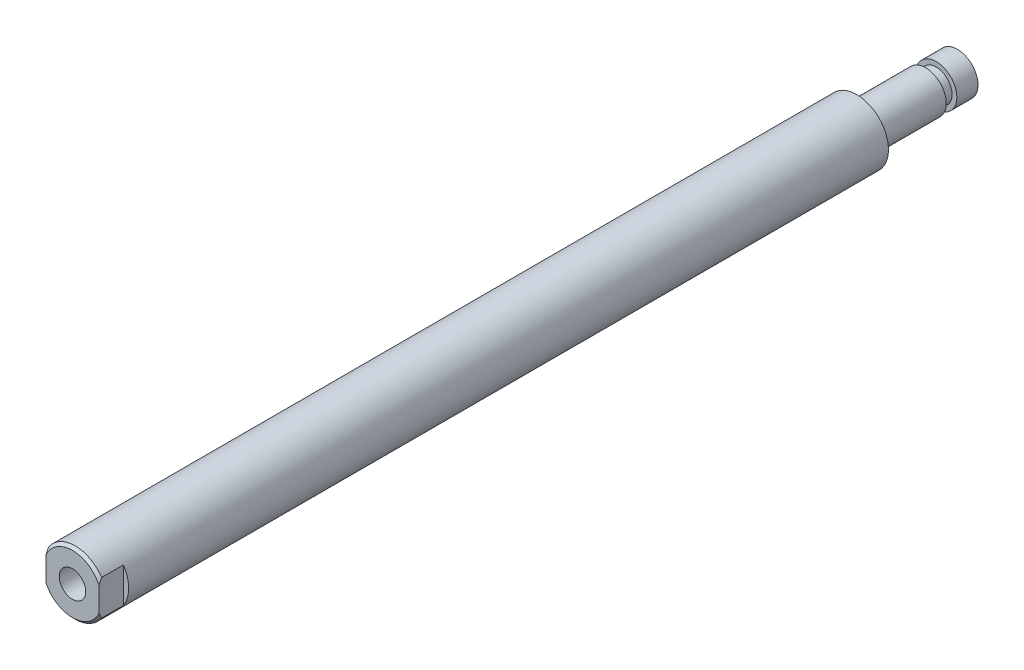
from build123d import *

# Parameters (mm, degrees)
ENL_V_MAT_EXTRU_1_DEPTH      = 168.21542991
ENL_V_MAT_EXTRU_1_DEPTH_BACK = 168.21542991
ESQUISSE2_W                  = 1
ESQUISSE2_H                  = 4.6
TROU_TARAUD_M61_D            = 5
TROU_TARAUD_M61_DEPTH        = 23
TROU_TARAUD_M61_TIP          = 1.502151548
CHANFREIN1_SIZE              = 0.5


with BuildPart() as part:
    # Esquisse1 → R_volution1 (revolve)
    with BuildSketch(Plane(origin=(0, 0, 0), x_dir=(0, 0, -1), z_dir=(1, 0, 0)), mode=Mode.PRIVATE) as r_volution1_sk:
        with BuildLine():
            Line((0, 0), (0, 6))
            Line((0, 6), (148, 6))
            Line((148, 6), (148, 3.9))
            ThreePointArc((148, 3.9), (148.5, 3.4), (149, 3.9))
            Line((149, 3.9), (161, 3.9))
            Line((161, 3.9), (161, 3))
            Line((161, 3), (163, 3))
            Line((163, 3), (163, 3.9))
            Line((163, 3.9), (167, 3.9))
            Line((167, 3.9), (167, 0))
            Line((167, 0), (0, 0))
        make_face()
    revolve(r_volution1_sk.sketch.rotate(Axis((0, 0, 0), (0, 0, 1)), 90), axis=Axis((0, 0, 0), (0, 0, 1)))

    # Esquisse2 → Enl_v. mat.-Extru.1 (cut, two sides: drawn at the far end of the back side and taken through both)
    with BuildSketch(Plane(origin=(0, 0, 0), x_dir=(1, 0, 0), z_dir=(0, 1, 0)).offset(-ENL_V_MAT_EXTRU_1_DEPTH_BACK)):
        with Locations((5.5, 2.3)):
            Rectangle(ESQUISSE2_W, ESQUISSE2_H)
        with Locations((-5.5, 2.3)):
            Rectangle(ESQUISSE2_W, ESQUISSE2_H)
    extrude(amount=ENL_V_MAT_EXTRU_1_DEPTH + ENL_V_MAT_EXTRU_1_DEPTH_BACK, mode=Mode.SUBTRACT)

    # Trou taraud_ M61
    with Locations(Plane.XY):
        with Locations((0, 0)):
            Hole(TROU_TARAUD_M61_D / 2, depth=TROU_TARAUD_M61_DEPTH)
            with Locations((0, 0, -(TROU_TARAUD_M61_DEPTH + TROU_TARAUD_M61_TIP / 2))):  # 118° drill point
                Cone(0, TROU_TARAUD_M61_D / 2, TROU_TARAUD_M61_TIP, mode=Mode.SUBTRACT)

    # Chanfrein1
    chanfrein1_edges = [part.edges().sort_by_distance(p)[0] for p in [
        (0, -6, 0),
        (0, 6, 0),
    ]]
    chamfer(chanfrein1_edges, length=CHANFREIN1_SIZE)


solid = part.part
